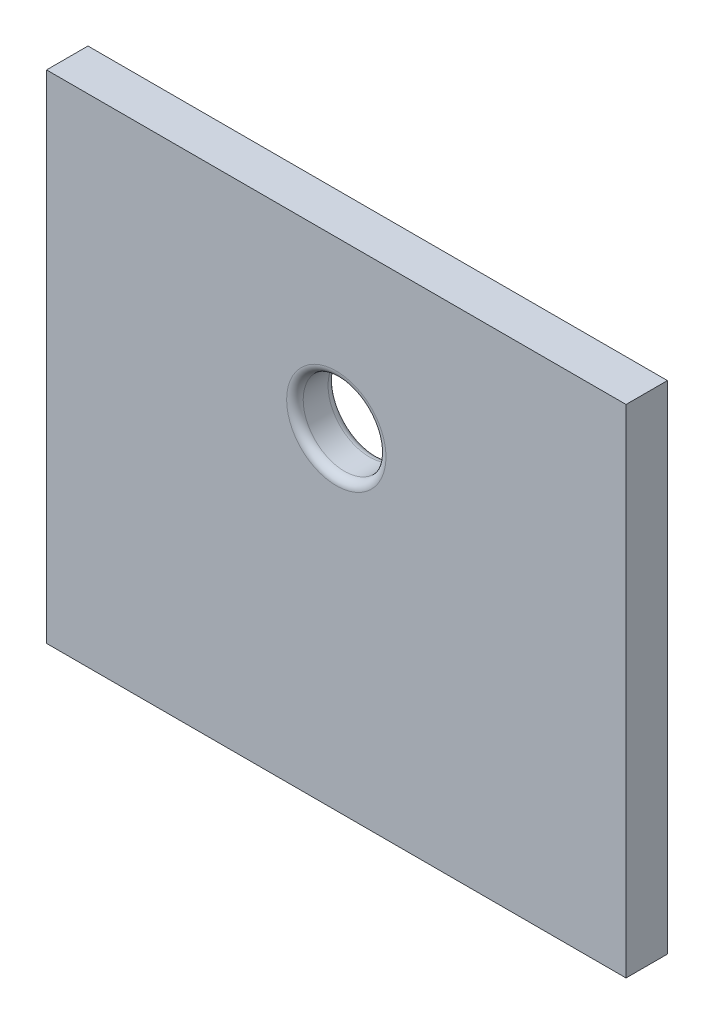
from build123d import *

# Parameters (mm, degrees)
SCHIZZO1_W                   = 70
SCHIZZO1_H                   = 60
SCHIZZO1_R                   = 5
ESTRUSIONE_ESTRUSIONE1_DEPTH = 5
RACCORDO1_R                  = 1


with BuildPart() as part:
    # Schizzo1 → Estrusione-Estrusione1 (new body)
    with BuildSketch(Plane.XY):
        Rectangle(SCHIZZO1_W, SCHIZZO1_H)
        with Locations((0, 10)):
            Circle(SCHIZZO1_R, mode=Mode.SUBTRACT)
    extrude(amount=ESTRUSIONE_ESTRUSIONE1_DEPTH)

    # Raccordo1
    raccordo1_edges = [part.edges().sort_by_distance(p)[0] for p in [
        (-5, 10, 0),
        (-5, 10, 5),
    ]]
    fillet(raccordo1_edges, radius=RACCORDO1_R)


solid = part.part
